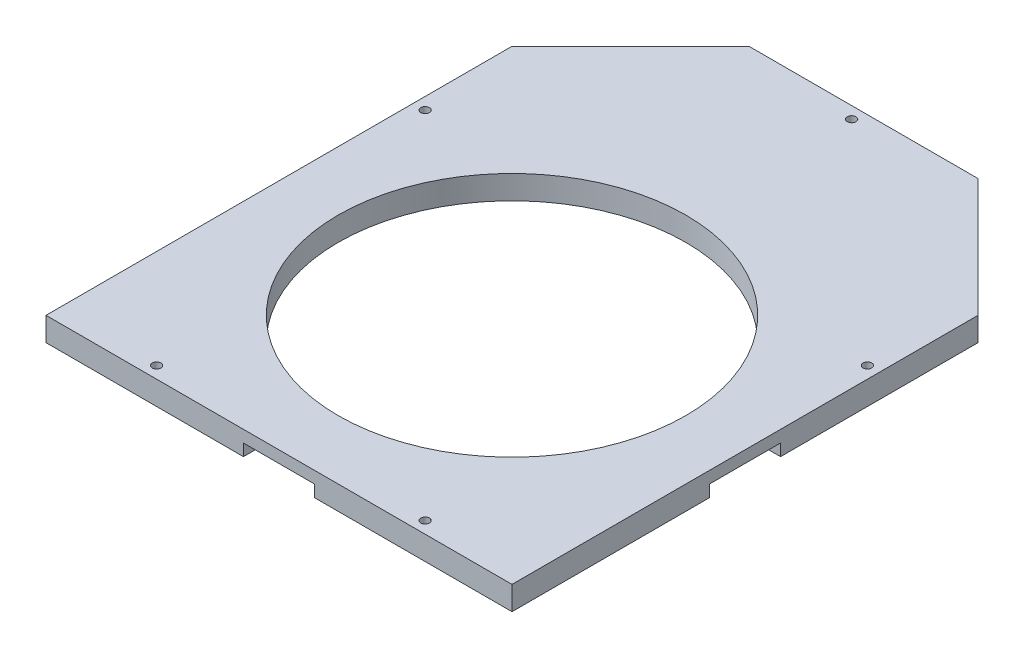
from build123d import *

# Parameters (mm, degrees)
ESQUISSE1_R             = 44
ESQUISSE1_R_2           = 1.1
BOSS_EXTRU_1_DEPTH      = 6
ENL_V_MAT_EXTRU_1_DEPTH = 3


with BuildPart() as part:
    # Esquisse1 → Boss.-Extru.1 (new body)
    with BuildSketch(Plane(origin=(0, 0, 0), x_dir=(1, 0, 0), z_dir=(0, 1, 0))):
        Polygon((-59, 59), (-29, 89), (29, 89), (59, 59), (59, -59), (-59, -59), align=None)
        with Locations(Location((0, 0, 0), (0, 0, 270))):
            Circle(ESQUISSE1_R, mode=Mode.SUBTRACT)
        with Locations(Location((-56, 34, 0), (0, 0, 270))):
            Circle(ESQUISSE1_R_2, mode=Mode.SUBTRACT)
        with Locations(Location((34, -56, 0), (0, 0, 90))):
            Circle(ESQUISSE1_R_2, mode=Mode.SUBTRACT)
        with Locations(Location((56, 34, 0), (0, 0, 90))):
            Circle(ESQUISSE1_R_2, mode=Mode.SUBTRACT)
        with Locations(Location((-34, -56, 0), (0, 0, 270))):
            Circle(ESQUISSE1_R_2, mode=Mode.SUBTRACT)
        with Locations(Location((0, 86, 0), (0, 0, 270))):
            Circle(ESQUISSE1_R_2, mode=Mode.SUBTRACT)
    extrude(amount=BOSS_EXTRU_1_DEPTH)

    # Esquisse2 → Enl_v. mat.-Extru.1 (cut)
    with BuildSketch(Plane(origin=(0, 0, 0), x_dir=(1, 0, 0), z_dir=(0, 1, 0))):
        with BuildLine():
            Line((53, 6.7372583), (53, -6.7372583))
            ThreePointArc((53, -6.7372583), (53, -9), (55.2627417, -9))
            Line((55.2627417, -9), (61.024031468, -9))
            Line((61.024031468, -9), (61.024031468, 9))
            Line((61.024031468, 9), (55.2627417, 9))
            ThreePointArc((55.2627417, 9), (53, 9), (53, 6.7372583))
        make_face()
        with BuildLine():
            Line((6.7372583, -53), (-6.7372583, -53))
            ThreePointArc((-6.7372583, -53), (-9, -53), (-9, -55.2627417))
            Line((-9, -55.2627417), (-9, -61.024031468))
            Line((-9, -61.024031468), (9, -61.024031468))
            Line((9, -61.024031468), (9, -55.2627417))
            ThreePointArc((9, -55.2627417), (9, -53), (6.7372583, -53))
        make_face()
        with BuildLine():
            Line((-53, -6.7372583), (-53, 6.7372583))
            ThreePointArc((-53, 6.7372583), (-53, 9), (-55.2627417, 9))
            Line((-55.2627417, 9), (-61.024031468, 9))
            Line((-61.024031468, 9), (-61.024031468, -9))
            Line((-61.024031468, -9), (-55.2627417, -9))
            ThreePointArc((-55.2627417, -9), (-53, -9), (-53, -6.7372583))
        make_face()
    extrude(amount=ENL_V_MAT_EXTRU_1_DEPTH, mode=Mode.SUBTRACT)


solid = part.part
